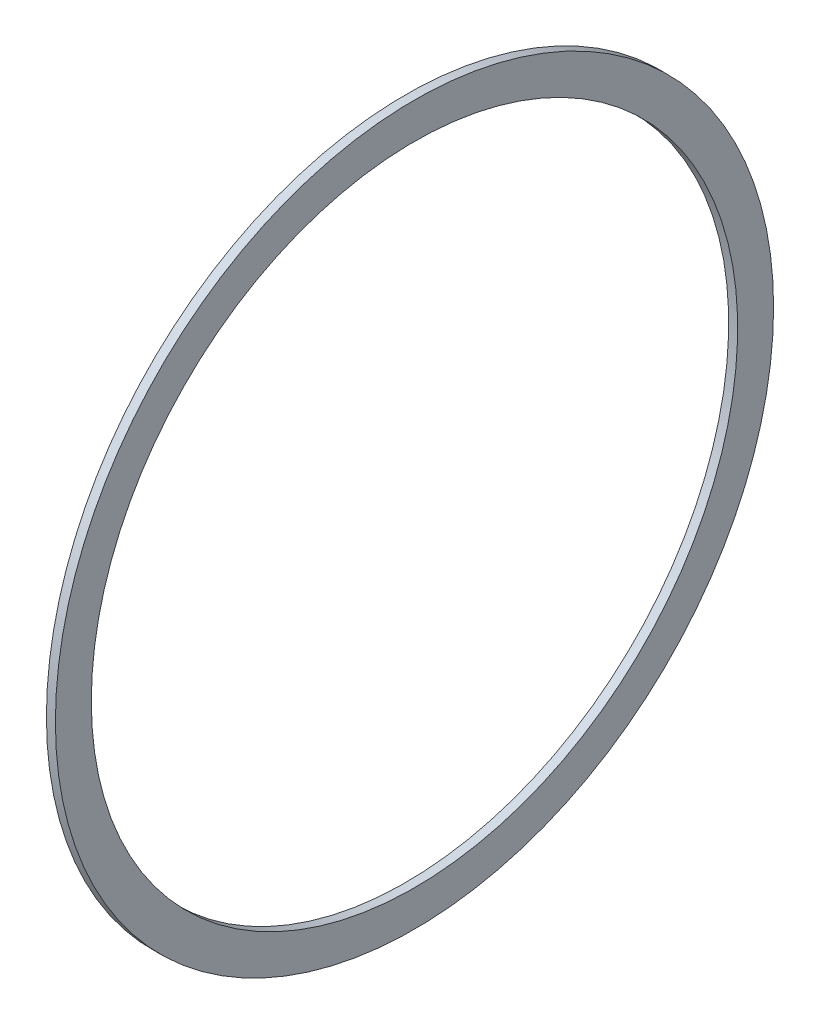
ISO-10303-21;
HEADER;
FILE_DESCRIPTION(('STEP AP214'),'2;1');
FILE_NAME('part.step','',(''),(''),'','','');
FILE_SCHEMA(('AUTOMOTIVE_DESIGN { 1 0 10303 214 1 1 1 1 }'));
ENDSEC;
DATA;
#1=APPLICATION_CONTEXT('core data for automotive mechanical design processes');
#2=APPLICATION_PROTOCOL_DEFINITION('international standard','automotive_design',2000,#1);
#3=PRODUCT_CONTEXT('',#1,'mechanical');
#4=PRODUCT('Part','Part','',(#3));
#5=PRODUCT_RELATED_PRODUCT_CATEGORY('part','',(#4));
#6=PRODUCT_DEFINITION_FORMATION('','',#4);
#7=PRODUCT_DEFINITION_CONTEXT('part definition',#1,'design');
#8=PRODUCT_DEFINITION('design','',#6,#7);
#9=PRODUCT_DEFINITION_SHAPE('','',#8);
#10=(LENGTH_UNIT() NAMED_UNIT(*) SI_UNIT(.MILLI.,.METRE.));
#11=(NAMED_UNIT(*) PLANE_ANGLE_UNIT() SI_UNIT($,.RADIAN.));
#12=(NAMED_UNIT(*) SI_UNIT($,.STERADIAN.) SOLID_ANGLE_UNIT());
#13=UNCERTAINTY_MEASURE_WITH_UNIT(LENGTH_MEASURE(1.E-05),#10,'distance_accuracy_value','');
#14=(GEOMETRIC_REPRESENTATION_CONTEXT(3) GLOBAL_UNCERTAINTY_ASSIGNED_CONTEXT((#13)) GLOBAL_UNIT_ASSIGNED_CONTEXT((#10,
#11,#12)) REPRESENTATION_CONTEXT('',''));
#15=CARTESIAN_POINT('',(0.,0.,0.));
#16=DIRECTION('',(0.,0.,1.));
#17=DIRECTION('',(1.,0.,0.));
#18=AXIS2_PLACEMENT_3D('',#15,#16,#17);
#19=CARTESIAN_POINT('',(0.,0.,-127.));
#20=DIRECTION('',(1.,0.,0.));
#21=DIRECTION('',(0.,0.,-1.));
#22=AXIS2_PLACEMENT_3D('',#19,#20,#21);
#23=PLANE('',#22);
#24=CARTESIAN_POINT('',(0.,0.,0.));
#25=DIRECTION('',(-1.,0.,0.));
#26=DIRECTION('',(0.,0.,1.));
#27=AXIS2_PLACEMENT_3D('',#24,#25,#26);
#28=CIRCLE('',#27,114.3);
#29=CARTESIAN_POINT('',(0.,0.,114.3));
#30=VERTEX_POINT('',#29);
#31=EDGE_CURVE('E10',#30,#30,#28,.T.);
#32=ORIENTED_EDGE('',*,*,#31,.F.);
#33=EDGE_LOOP('',(#32));
#34=FACE_BOUND('',#33,.T.);
#35=CARTESIAN_POINT('',(0.,0.,0.));
#36=DIRECTION('',(-1.,0.,0.));
#37=DIRECTION('',(0.,0.,1.));
#38=AXIS2_PLACEMENT_3D('',#35,#36,#37);
#39=CIRCLE('',#38,127.);
#40=CARTESIAN_POINT('',(0.,0.,127.));
#41=VERTEX_POINT('',#40);
#42=EDGE_CURVE('E45',#41,#41,#39,.T.);
#43=ORIENTED_EDGE('',*,*,#42,.T.);
#44=EDGE_LOOP('',(#43));
#45=FACE_BOUND('',#44,.T.);
#46=ADVANCED_FACE('F31',(#34,#45),#23,.F.);
#47=CARTESIAN_POINT('',(0.,0.,0.));
#48=DIRECTION('',(-1.,0.,0.));
#49=DIRECTION('',(0.,0.,1.));
#50=AXIS2_PLACEMENT_3D('',#47,#48,#49);
#51=CYLINDRICAL_SURFACE('',#50,114.3);
#52=CARTESIAN_POINT('',(3.175,0.,0.));
#53=DIRECTION('',(-1.,0.,0.));
#54=DIRECTION('',(0.,0.,1.));
#55=AXIS2_PLACEMENT_3D('',#52,#53,#54);
#56=CIRCLE('',#55,114.3);
#57=CARTESIAN_POINT('',(3.175,0.,114.3));
#58=VERTEX_POINT('',#57);
#59=EDGE_CURVE('E37',#58,#58,#56,.T.);
#60=ORIENTED_EDGE('',*,*,#59,.F.);
#61=EDGE_LOOP('',(#60));
#62=FACE_BOUND('',#61,.T.);
#63=ORIENTED_EDGE('',*,*,#31,.T.);
#64=EDGE_LOOP('',(#63));
#65=FACE_BOUND('',#64,.T.);
#66=ADVANCED_FACE('F60',(#62,#65),#51,.F.);
#67=CARTESIAN_POINT('',(3.175,0.,-127.));
#68=DIRECTION('',(-1.,0.,0.));
#69=DIRECTION('',(0.,0.,1.));
#70=AXIS2_PLACEMENT_3D('',#67,#68,#69);
#71=PLANE('',#70);
#72=CARTESIAN_POINT('',(3.175,0.,0.));
#73=DIRECTION('',(-1.,0.,0.));
#74=DIRECTION('',(0.,0.,1.));
#75=AXIS2_PLACEMENT_3D('',#72,#73,#74);
#76=CIRCLE('',#75,127.);
#77=CARTESIAN_POINT('',(3.175,0.,127.));
#78=VERTEX_POINT('',#77);
#79=EDGE_CURVE('E41',#78,#78,#76,.T.);
#80=ORIENTED_EDGE('',*,*,#79,.F.);
#81=EDGE_LOOP('',(#80));
#82=FACE_BOUND('',#81,.T.);
#83=ORIENTED_EDGE('',*,*,#59,.T.);
#84=EDGE_LOOP('',(#83));
#85=FACE_BOUND('',#84,.T.);
#86=ADVANCED_FACE('F55',(#82,#85),#71,.F.);
#87=CARTESIAN_POINT('',(0.,0.,0.));
#88=DIRECTION('',(-1.,0.,0.));
#89=DIRECTION('',(0.,0.,1.));
#90=AXIS2_PLACEMENT_3D('',#87,#88,#89);
#91=CYLINDRICAL_SURFACE('',#90,127.);
#92=ORIENTED_EDGE('',*,*,#42,.F.);
#93=EDGE_LOOP('',(#92));
#94=FACE_BOUND('',#93,.T.);
#95=ORIENTED_EDGE('',*,*,#79,.T.);
#96=EDGE_LOOP('',(#95));
#97=FACE_BOUND('',#96,.T.);
#98=ADVANCED_FACE('F52',(#94,#97),#91,.T.);
#99=CLOSED_SHELL('',(#46,#66,#86,#98));
#100=MANIFOLD_SOLID_BREP('B2',#99);
#101=ADVANCED_BREP_SHAPE_REPRESENTATION('',(#18,#100),#14);
#102=SHAPE_DEFINITION_REPRESENTATION(#9,#101);
ENDSEC;
END-ISO-10303-21;
